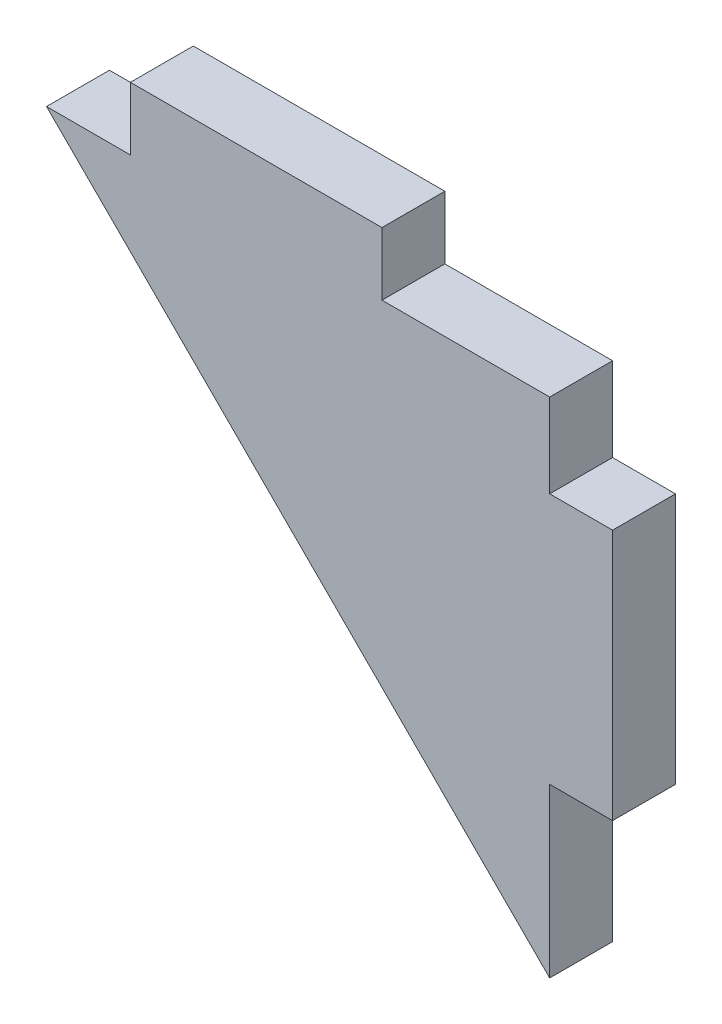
from build123d import *

# Parameters (mm, degrees)
SKETCH1_W           = 76.2
SKETCH1_H           = 19.05
SKETCH1_W_2         = 19.05
SKETCH1_H_2         = 76.2
BOSS_EXTRUDE1_DEPTH = 19.05


with BuildPart() as part:
    # Sketch1 → Boss-Extrude1 (new body)
    with BuildSketch(Plane.XY):
        Polygon((-152.4, 0), (0, -152.4), (0, 0), align=None)
        with Locations((-88.9, 9.525)):
            Rectangle(SKETCH1_W, SKETCH1_H)
        with Locations((9.525, -63.5)):
            Rectangle(SKETCH1_W_2, SKETCH1_H_2)
    extrude(amount=BOSS_EXTRUDE1_DEPTH)


solid = part.part
